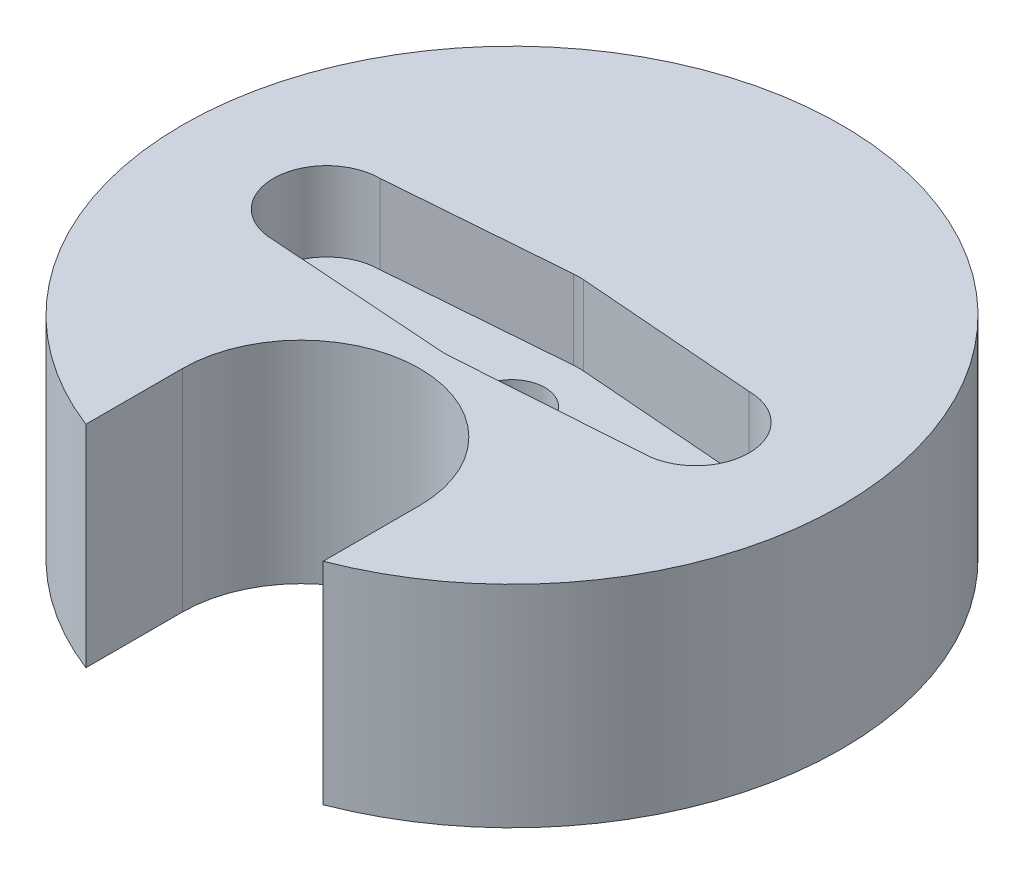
from build123d import *

# Parameters (mm, degrees)
Y_KSEKLIK_EKSTR_ZYON1_DEPTH = 5
IZIM2_R                     = 2.5
KES_EKSTR_ZYON3_DEPTH       = 2.5
IZIM3_R                     = 1.25
KES_EKSTR_ZYON4_DEPTH       = 18.853571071
IZIM5_R                     = 0.6
KES_EKSTR_ZYON5_DEPTH       = 2.5
Y_KSEKLIK_EKSTR_ZYON3_DEPTH = 3


with BuildPart() as part:
    # izim1 → Y_kseklik-Ekstr_zyon1 (new body)
    with BuildSketch(Plane(origin=(0, 0, 0), x_dir=(1, 0, 0), z_dir=(0, 1, 0))):
        with BuildLine():
            Line((-4.5, -8), (-4.5, -11.66190379))
            ThreePointArc((-4.5, -11.66190379), (0, 12.5), (4.5, -11.66190379))
            Line((4.5, -11.66190379), (4.5, -8))
            ThreePointArc((4.5, -8), (0, -3.5), (-4.5, -8))
        make_face()
    extrude(amount=Y_KSEKLIK_EKSTR_ZYON1_DEPTH)

    # izim2 → Kes-Ekstr_zyon3 (cut)
    with BuildSketch(Plane(origin=(0, 0, 0), x_dir=(1, 0, 0), z_dir=(0, 1, 0))):
        with Locations(Location((0, 0, 0), (0, 0, 270))):
            Circle(IZIM2_R)
    extrude(amount=KES_EKSTR_ZYON3_DEPTH, mode=Mode.SUBTRACT)

    # izim3 → Kes-Ekstr_zyon4 (cut, through all)
    with BuildSketch(Plane.XZ.offset(-2.5)):
        with Locations(Location((0, 0, 0), (0, 0, 270))):
            Circle(IZIM3_R)
    extrude(amount=-KES_EKSTR_ZYON4_DEPTH, mode=Mode.SUBTRACT)

    # izim5 → Kes-Ekstr_zyon5 (cut)
    with BuildSketch(Plane(origin=(0, 5, 0), x_dir=(1, 0, 0), z_dir=(0, 1, 0))):
        with Locations(Location((-6.449994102, -0.008722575, 0), (0, 0, 270))):
            Circle(IZIM5_R)
        with Locations(Location((6.449994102, 0.008722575, 0), (0, 0, 270))):
            Circle(IZIM5_R)
    extrude(amount=-KES_EKSTR_ZYON5_DEPTH, mode=Mode.SUBTRACT)

    # izim6 → Y_kseklik-Ekstr_zyon3 (add)
    with BuildSketch(Plane(origin=(0, 5, 0), x_dir=(1, 0, 0), z_dir=(0, 1, 0))):
        with BuildLine():
            Line((-4.5, -11.66190379), (-4.5, -8))
            ThreePointArc((-4.5, -8), (0, -3.5), (4.5, -8))
            Line((4.5, -8), (4.5, -11.66190379))
            ThreePointArc((4.5, -11.66190379), (0, 12.5), (-4.5, -11.66190379))
        make_face()
        with BuildLine():
            Line((7, 1.991277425), (0.197348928, 2.523314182))
            ThreePointArc((0.197348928, 2.523314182), (0, 2.531019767), (-0.197348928, 2.523314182))
            Line((-0.197348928, 2.523314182), (-7, 1.991277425))
            ThreePointArc((-7, 1.991277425), (-9.021556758, -0.030279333), (-7, -2.051836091))
            Line((-7, -2.051836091), (-0.175036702, -2.524960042))
            ThreePointArc((-0.175036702, -2.524960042), (0, -2.531019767), (0.175036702, -2.524960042))
            Line((0.175036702, -2.524960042), (7, -2.051836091))
            ThreePointArc((7, -2.051836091), (9.021556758, -0.030279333), (7, 1.991277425))
        make_face(mode=Mode.SUBTRACT)
    extrude(amount=Y_KSEKLIK_EKSTR_ZYON3_DEPTH)


solid = part.part
